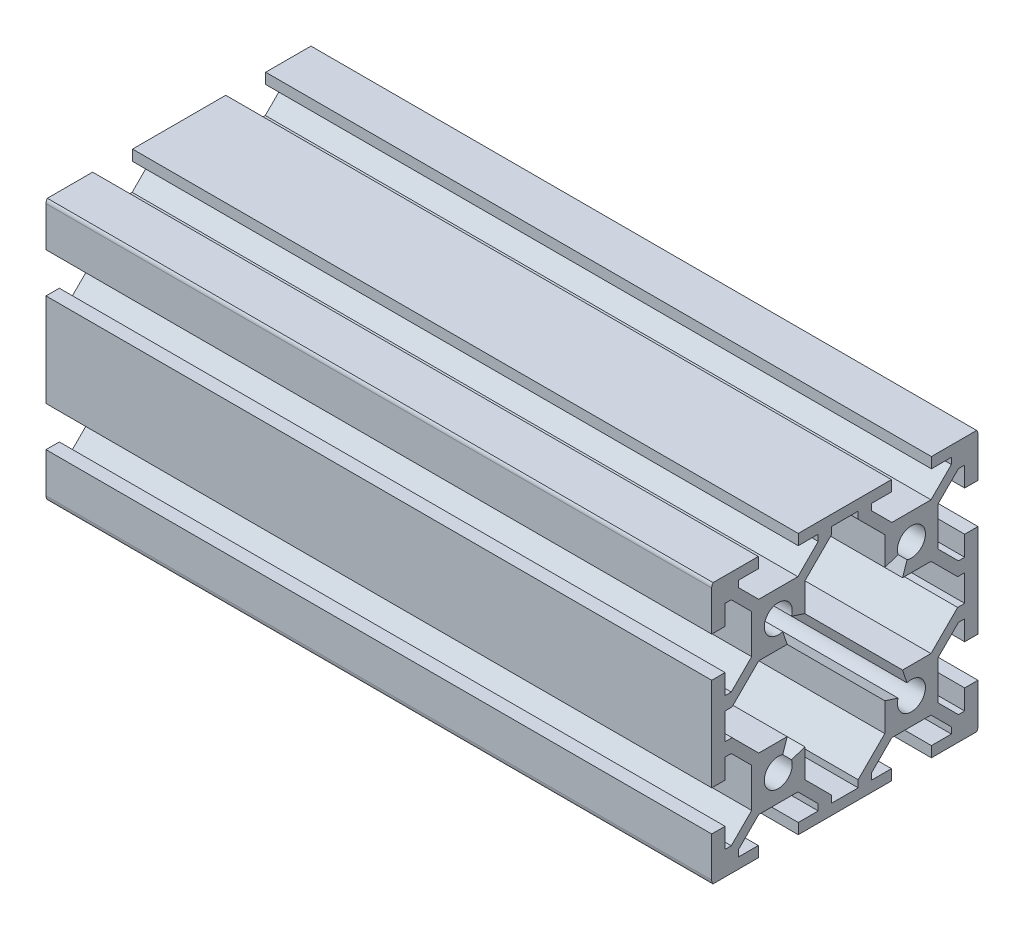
from build123d import *

# Parameters (mm, degrees)
BOSS_EXTRUDE1_DEPTH = 100


with BuildPart() as part:
    # Sketch1 → Boss-Extrude1 (new body)
    with BuildSketch(Plane(origin=(0, 0, 0), x_dir=(0, 0, -1), z_dir=(1, 0, 0))):
        with BuildLine():
            Line((-20, 19), (-20, 13))
            Line((-20, 13), (-18, 13))
            Line((-18, 13), (-18, 16))
            Line((-18, 16), (-17.060660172, 16))
            Line((-17.060660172, 16), (-14, 12.939339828))
            Line((-14, 12.939339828), (-14, 7.060660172))
            Line((-14, 7.060660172), (-17.060660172, 4))
            Line((-17.060660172, 4), (-18, 4))
            Line((-18, 4), (-18, 7))
            Line((-18, 7), (-20, 7))
            Line((-20, 7), (-20, -7))
            Line((-20, -7), (-18, -7))
            Line((-18, -7), (-18, -4))
            Line((-18, -4), (-17.060660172, -4))
            Line((-17.060660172, -4), (-14, -7.060660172))
            Line((-14, -7.060660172), (-14, -12.939339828))
            Line((-14, -12.939339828), (-17.060660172, -16))
            Line((-17.060660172, -16), (-18, -16))
            Line((-18, -16), (-18, -13))
            Line((-18, -13), (-20, -13))
            Line((-20, -13), (-20, -19))
            ThreePointArc((-20, -19), (-19.948683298, -19.316227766), (-19.8, -19.6))
            Line((-19.8, -19.6), (-13, -19.6))
            Line((-13, -19.6), (-13, -18))
            Line((-13, -18), (-16, -18))
            Line((-16, -18), (-16, -17.060660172))
            Line((-16, -17.060660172), (-12.939339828, -14))
            Line((-12.939339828, -14), (-7.060660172, -14))
            Line((-7.060660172, -14), (-4, -17.060660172))
            Line((-4, -17.060660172), (-4, -18))
            Line((-4, -18), (-7, -18))
            Line((-7, -18), (-7, -19.6))
            Line((-7, -19.6), (7, -19.6))
            Line((7, -19.6), (7, -18))
            Line((7, -18), (4, -18))
            Line((4, -18), (4, -17.060660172))
            Line((4, -17.060660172), (7.060660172, -14))
            Line((7.060660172, -14), (12.939339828, -14))
            Line((12.939339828, -14), (16, -17.060660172))
            Line((16, -17.060660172), (16, -18))
            Line((16, -18), (13, -18))
            Line((13, -18), (13, -19.6))
            Line((13, -19.6), (19.8, -19.6))
            ThreePointArc((19.8, -19.6), (19.948683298, -19.316227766), (20, -19))
            Line((20, -19), (20, -13))
            Line((20, -13), (18, -13))
            Line((18, -13), (18, -16))
            Line((18, -16), (17.060660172, -16))
            Line((17.060660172, -16), (14, -12.939339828))
            Line((14, -12.939339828), (14, -7.060660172))
            Line((14, -7.060660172), (17.060660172, -4))
            Line((17.060660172, -4), (18, -4))
            Line((18, -4), (18, -7))
            Line((18, -7), (20, -7))
            Line((20, -7), (20, 7))
            Line((20, 7), (18, 7))
            Line((18, 7), (18, 4))
            Line((18, 4), (17.060660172, 4))
            Line((17.060660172, 4), (14, 7.060660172))
            Line((14, 7.060660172), (14, 12.939339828))
            Line((14, 12.939339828), (17.060660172, 16))
            Line((17.060660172, 16), (18, 16))
            Line((18, 16), (18, 13))
            Line((18, 13), (20, 13))
            Line((20, 13), (20, 19))
            ThreePointArc((20, 19), (19.948683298, 19.316227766), (19.8, 19.6))
            Line((19.8, 19.6), (13, 19.6))
            Line((13, 19.6), (13, 18))
            Line((13, 18), (16, 18))
            Line((16, 18), (16, 17.060660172))
            Line((16, 17.060660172), (12.939339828, 14))
            Line((12.939339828, 14), (7.060660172, 14))
            Line((7.060660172, 14), (4, 17.060660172))
            Line((4, 17.060660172), (4, 18))
            Line((4, 18), (7, 18))
            Line((7, 18), (7, 19.6))
            Line((7, 19.6), (-7, 19.6))
            Line((-7, 19.6), (-7, 18))
            Line((-7, 18), (-4, 18))
            Line((-4, 18), (-4, 17.060660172))
            Line((-4, 17.060660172), (-7.060660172, 14))
            Line((-7.060660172, 14), (-12.939339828, 14))
            Line((-12.939339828, 14), (-16, 17.060660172))
            Line((-16, 17.060660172), (-16, 18))
            Line((-16, 18), (-13, 18))
            Line((-13, 18), (-13, 19.6))
            Line((-13, 19.6), (-19.8, 19.6))
            ThreePointArc((-19.8, 19.6), (-19.948683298, 19.316227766), (-20, 19))
        make_face()
        with BuildLine():
            Line((-16.939339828, 2), (-18, 2))
            Line((-18, 2), (-18, -2))
            Line((-18, -2), (-16.939339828, -2))
            Line((-16.939339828, -2), (-12.939339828, -6))
            Line((-12.939339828, -6), (-8.666662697, -6))
            Line((-8.666662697, -6), (-9.335919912, -8.007765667))
            ThreePointArc((-9.335919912, -8.007765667), (-11.48492424, -11.48492424), (-8.007765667, -9.335919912))
            Line((-8.007765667, -9.335919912), (-6, -8.666662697))
            Line((-6, -8.666662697), (-6, -12.939339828))
            Line((-6, -12.939339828), (-2, -16.939339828))
            Line((-2, -16.939339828), (-2, -18))
            Line((-2, -18), (2, -18))
            Line((2, -18), (2, -16.939339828))
            Line((2, -16.939339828), (6, -12.939339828))
            Line((6, -12.939339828), (6, -8.666662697))
            Line((6, -8.666662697), (8.007765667, -9.335919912))
            ThreePointArc((8.007765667, -9.335919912), (11.48492424, -11.48492424), (9.335919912, -8.007765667))
            Line((9.335919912, -8.007765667), (8.666662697, -6))
            Line((8.666662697, -6), (12.939339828, -6))
            Line((12.939339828, -6), (16.939339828, -2))
            Line((16.939339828, -2), (18, -2))
            Line((18, -2), (18, 2))
            Line((18, 2), (16.939339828, 2))
            Line((16.939339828, 2), (12.939339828, 6))
            Line((12.939339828, 6), (8.666662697, 6))
            Line((8.666662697, 6), (9.335919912, 8.007765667))
            ThreePointArc((9.335919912, 8.007765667), (11.48492424, 11.48492424), (8.007765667, 9.335919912))
            Line((8.007765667, 9.335919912), (6, 8.666662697))
            Line((6, 8.666662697), (6, 12.939339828))
            Line((6, 12.939339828), (2, 16.939339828))
            Line((2, 16.939339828), (2, 18))
            Line((2, 18), (-2, 18))
            Line((-2, 18), (-2, 16.939339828))
            Line((-2, 16.939339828), (-6, 12.939339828))
            Line((-6, 12.939339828), (-6, 8.666662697))
            Line((-6, 8.666662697), (-8.007765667, 9.335919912))
            ThreePointArc((-8.007765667, 9.335919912), (-11.48492424, 11.48492424), (-9.335919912, 8.007765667))
            Line((-9.335919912, 8.007765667), (-8.666662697, 6))
            Line((-8.666662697, 6), (-12.939339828, 6))
            Line((-12.939339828, 6), (-16.939339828, 2))
        make_face(mode=Mode.SUBTRACT)
    extrude(amount=BOSS_EXTRUDE1_DEPTH)


solid = part.part
